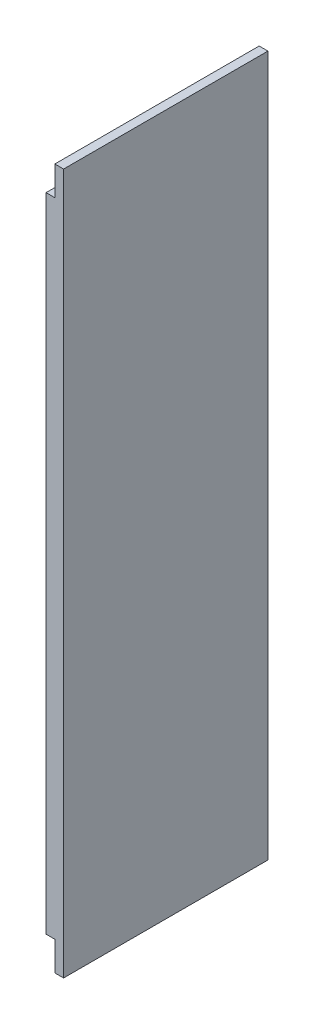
from build123d import *

# Parameters (mm, degrees)
SKETCH_2_W      = 3
SKETCH_2_H      = 240
EXTRUDE_1_DEPTH = 70
EXTRUDE_START   = -70
SKETCH_3_W      = 3
SKETCH_3_H      = 220.001872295
EXTRUDE_2_DEPTH = 70


with BuildPart() as part:
    # Sketch 2 → Extrude 1 (new body)
    with BuildSketch(Plane.XY):
        with Locations((-95.5, -120)):
            Rectangle(SKETCH_2_W, SKETCH_2_H)
    extrude(amount=-EXTRUDE_1_DEPTH)

    # Sketch 3 → Extrude 2 (add)
    with BuildSketch(Plane.XY.offset(EXTRUDE_START)):
        with Locations((-98.5, -120.000936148)):
            Rectangle(SKETCH_3_W, SKETCH_3_H)
    extrude(amount=EXTRUDE_2_DEPTH)


solid = part.part
